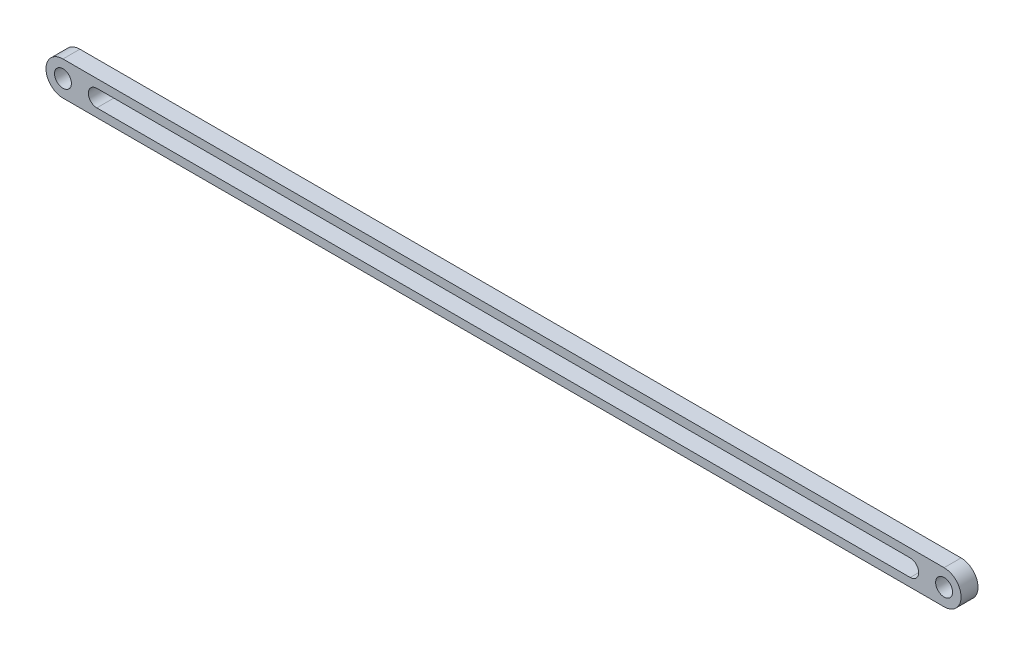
from build123d import *

# Parameters (mm, degrees)
SKETCH1_R           = 1.5875
BOSS_EXTRUDE1_DEPTH = 3.175


with BuildPart() as part:
    # Sketch1 → Boss-Extrude1 (new body)
    with BuildSketch(Plane.XY):
        with BuildLine():
            Line((0, 3.175), (165.1, 3.175))
            ThreePointArc((165.1, 3.175), (168.275, 0), (165.1, -3.175))
            Line((165.1, -3.175), (0, -3.175))
            ThreePointArc((0, -3.175), (-3.175, 0), (0, 3.175))
        make_face()
        Circle(SKETCH1_R, mode=Mode.SUBTRACT)
        with Locations((165.1, 0)):
            Circle(SKETCH1_R, mode=Mode.SUBTRACT)
        with BuildLine():
            Line((6.35, 1.5875), (158.75, 1.5875))
            ThreePointArc((158.75, 1.5875), (160.3375, 0), (158.75, -1.5875))
            Line((158.75, -1.5875), (6.35, -1.5875))
            ThreePointArc((6.35, -1.5875), (4.7625, 0), (6.35, 1.5875))
        make_face(mode=Mode.SUBTRACT)
    extrude(amount=BOSS_EXTRUDE1_DEPTH)


solid = part.part
